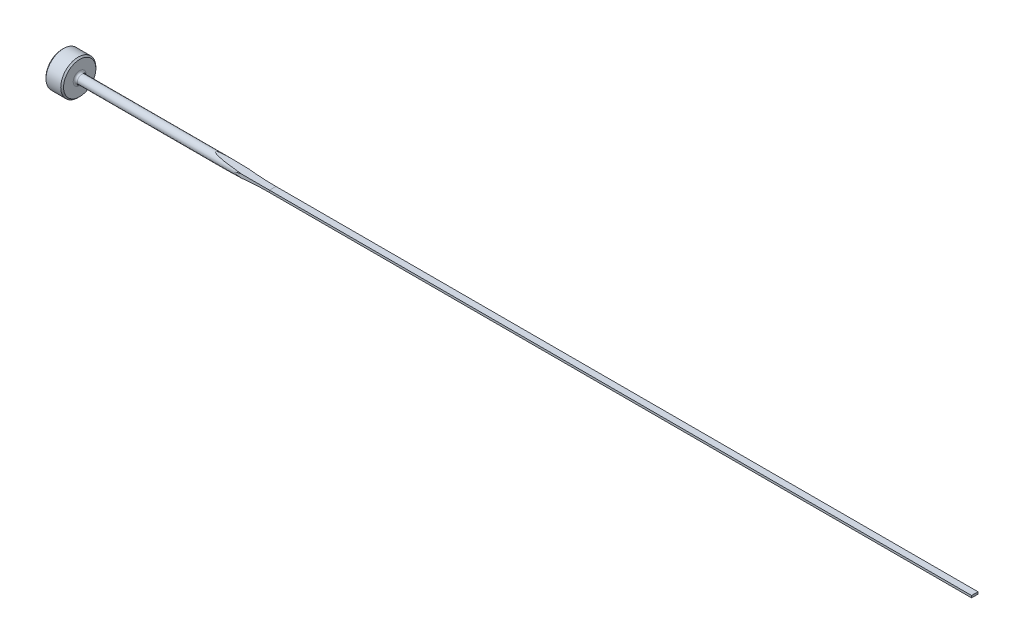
from build123d import *

# Parameters (mm, degrees)
CUT_EXTRUDE1_DEPTH = 166.161046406
CUT_EXTRUDE2_DEPTH = 166.161046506
FILLET1_R          = 0.381
CHAMFER1_SIZE      = 0.254


with BuildPart() as part:
    # Sketch1 → Revolve1 (revolve)
    with BuildSketch(Plane.XY, mode=Mode.PRIVATE) as revolve1_sk:
        Polygon((0, 0), (0, 3.175), (3.175, 3.175), (3.175, 0.79375), (165.1, 0.79375), (165.1, 0), align=None)
    revolve(revolve1_sk.sketch.rotate(Axis((0, 0, 0), (1, 0, 0)), 90), axis=Axis((0, 0, 0), (1, 0, 0)))

    # Sketch2 → Cut-Extrude1 (cut, symmetric)
    with BuildSketch(Plane.XY):
        with BuildLine():
            Line((165.1, 0.79375), (165.1, 0.1905))
            Line((165.1, 0.1905), (38.1, 0.1905))
            ThreePointArc((38.1, 0.1905), (32.921731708, 0.341440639), (27.761047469, 0.79375))
            Line((27.761047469, 0.79375), (165.1, 0.79375))
        make_face()
    cut_extrude1 = extrude(amount=CUT_EXTRUDE1_DEPTH, both=True, mode=Mode.SUBTRACT)

    # Mirror1: Cut-Extrude1 across plane
    add(cut_extrude1.mirror(Plane.ZX), mode=Mode.SUBTRACT)

    # Sketch3 → Cut-Extrude2 (cut, symmetric)
    with BuildSketch(Plane(origin=(0, 0, 0), x_dir=(1, 0, 0), z_dir=(0, 1, 0))):
        with BuildLine():
            Line((165.1, 0.79375), (165.1, 0.5842))
            Line((165.1, 0.5842), (38.1, 0.5842))
            ThreePointArc((38.1, 0.5842), (35.04803383, 0.636602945), (31.999665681, 0.79375))
            Line((31.999665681, 0.79375), (165.1, 0.79375))
        make_face()
    cut_extrude2 = extrude(amount=CUT_EXTRUDE2_DEPTH, both=True, mode=Mode.SUBTRACT)

    # Mirror2: Cut-Extrude2 across plane
    add(cut_extrude2.mirror(Plane.XY), mode=Mode.SUBTRACT)

    # Fillet1
    fillet1_edges = [part.edges().sort_by_distance(p)[0] for p in [
        (3.175, 0, -0.79375),
    ]]
    fillet(fillet1_edges, radius=FILLET1_R)

    # Chamfer1
    chamfer1_edges = [part.edges().sort_by_distance(p)[0] for p in [
        (3.175, 0, -3.175),
        (0, 0, -3.175),
    ]]
    chamfer(chamfer1_edges, length=CHAMFER1_SIZE)


solid = part.part
